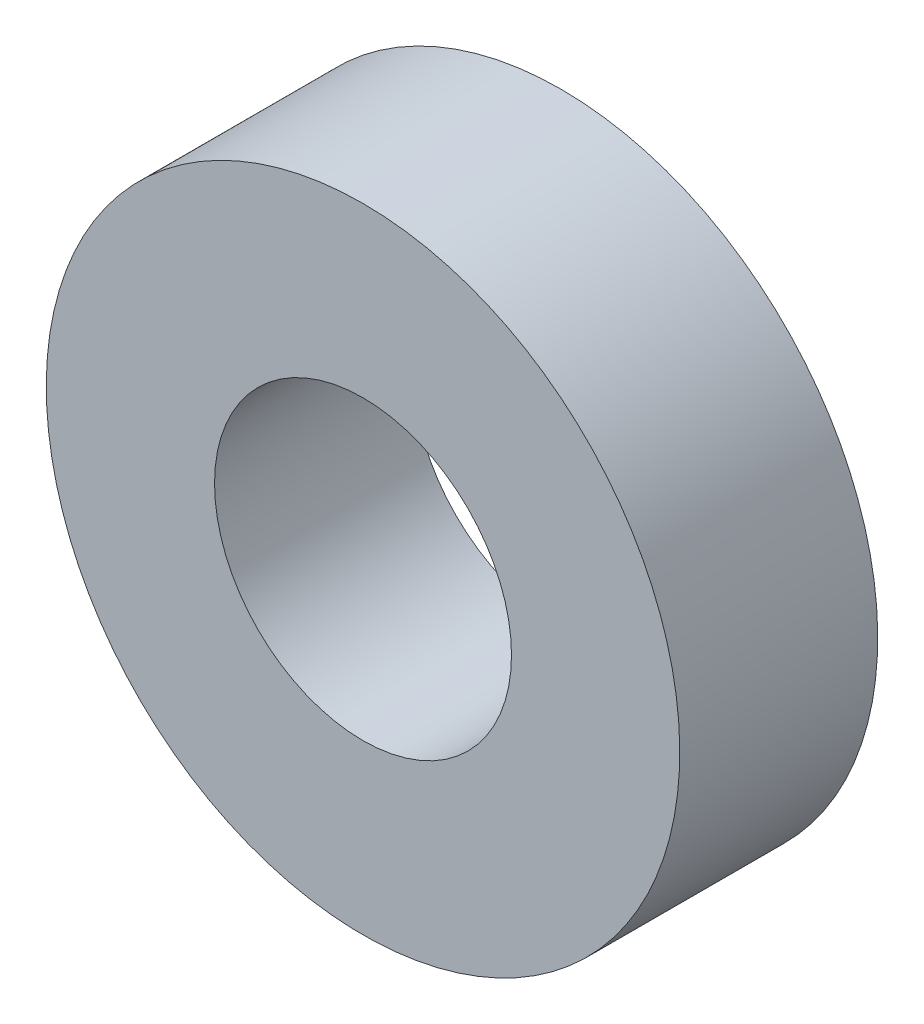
ISO-10303-21;
HEADER;
FILE_DESCRIPTION(('STEP AP214'),'2;1');
FILE_NAME('part.step','',(''),(''),'','','');
FILE_SCHEMA(('AUTOMOTIVE_DESIGN { 1 0 10303 214 1 1 1 1 }'));
ENDSEC;
DATA;
#1=APPLICATION_CONTEXT('core data for automotive mechanical design processes');
#2=APPLICATION_PROTOCOL_DEFINITION('international standard','automotive_design',2000,#1);
#3=PRODUCT_CONTEXT('',#1,'mechanical');
#4=PRODUCT('Part','Part','',(#3));
#5=PRODUCT_RELATED_PRODUCT_CATEGORY('part','',(#4));
#6=PRODUCT_DEFINITION_FORMATION('','',#4);
#7=PRODUCT_DEFINITION_CONTEXT('part definition',#1,'design');
#8=PRODUCT_DEFINITION('design','',#6,#7);
#9=PRODUCT_DEFINITION_SHAPE('','',#8);
#10=(LENGTH_UNIT() NAMED_UNIT(*) SI_UNIT(.MILLI.,.METRE.));
#11=(NAMED_UNIT(*) PLANE_ANGLE_UNIT() SI_UNIT($,.RADIAN.));
#12=(NAMED_UNIT(*) SI_UNIT($,.STERADIAN.) SOLID_ANGLE_UNIT());
#13=UNCERTAINTY_MEASURE_WITH_UNIT(LENGTH_MEASURE(1.E-05),#10,'distance_accuracy_value','');
#14=(GEOMETRIC_REPRESENTATION_CONTEXT(3) GLOBAL_UNCERTAINTY_ASSIGNED_CONTEXT((#13)) GLOBAL_UNIT_ASSIGNED_CONTEXT((#10,
#11,#12)) REPRESENTATION_CONTEXT('',''));
#15=CARTESIAN_POINT('',(0.,0.,0.));
#16=DIRECTION('',(0.,0.,1.));
#17=DIRECTION('',(1.,0.,0.));
#18=AXIS2_PLACEMENT_3D('',#15,#16,#17);
#19=CARTESIAN_POINT('',(0.,0.,-7.));
#20=DIRECTION('',(0.,0.,1.));
#21=DIRECTION('',(0.,-1.,0.));
#22=AXIS2_PLACEMENT_3D('',#19,#20,#21);
#23=PLANE('',#22);
#24=CARTESIAN_POINT('',(0.,0.,-7.));
#25=DIRECTION('',(0.,0.,-1.));
#26=DIRECTION('',(0.,1.,0.));
#27=AXIS2_PLACEMENT_3D('',#24,#25,#26);
#28=CIRCLE('',#27,7.5);
#29=CARTESIAN_POINT('',(0.,7.50000000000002,-7.));
#30=VERTEX_POINT('',#29);
#31=EDGE_CURVE('E32',#30,#30,#28,.F.);
#32=ORIENTED_EDGE('',*,*,#31,.T.);
#33=EDGE_LOOP('',(#32));
#34=FACE_BOUND('',#33,.T.);
#35=CARTESIAN_POINT('',(0.,0.,-7.));
#36=DIRECTION('',(0.,0.,-1.));
#37=DIRECTION('',(0.,1.,0.));
#38=AXIS2_PLACEMENT_3D('',#35,#36,#37);
#39=CIRCLE('',#38,16.);
#40=CARTESIAN_POINT('',(0.,16.,-7.));
#41=VERTEX_POINT('',#40);
#42=EDGE_CURVE('E18',#41,#41,#39,.F.);
#43=ORIENTED_EDGE('',*,*,#42,.F.);
#44=EDGE_LOOP('',(#43));
#45=FACE_BOUND('',#44,.T.);
#46=ADVANCED_FACE('F14',(#34,#45),#23,.F.);
#47=CARTESIAN_POINT('',(0.,0.,3.));
#48=DIRECTION('',(0.,0.,-1.));
#49=DIRECTION('',(0.,1.,0.));
#50=AXIS2_PLACEMENT_3D('',#47,#48,#49);
#51=CYLINDRICAL_SURFACE('',#50,16.);
#52=ORIENTED_EDGE('',*,*,#42,.T.);
#53=EDGE_LOOP('',(#52));
#54=FACE_BOUND('',#53,.T.);
#55=CARTESIAN_POINT('',(0.,0.,3.));
#56=DIRECTION('',(0.,0.,-1.));
#57=DIRECTION('',(0.,1.,0.));
#58=AXIS2_PLACEMENT_3D('',#55,#56,#57);
#59=CIRCLE('',#58,16.);
#60=CARTESIAN_POINT('',(0.,16.,3.));
#61=VERTEX_POINT('',#60);
#62=EDGE_CURVE('E23',#61,#61,#59,.F.);
#63=ORIENTED_EDGE('',*,*,#62,.F.);
#64=EDGE_LOOP('',(#63));
#65=FACE_BOUND('',#64,.T.);
#66=ADVANCED_FACE('F40',(#54,#65),#51,.T.);
#67=CARTESIAN_POINT('',(0.,0.,3.));
#68=DIRECTION('',(0.,0.,-1.));
#69=DIRECTION('',(0.,1.,0.));
#70=AXIS2_PLACEMENT_3D('',#67,#68,#69);
#71=CYLINDRICAL_SURFACE('',#70,7.5);
#72=CARTESIAN_POINT('',(0.,0.,3.));
#73=DIRECTION('',(0.,0.,-1.));
#74=DIRECTION('',(0.,1.,0.));
#75=AXIS2_PLACEMENT_3D('',#72,#73,#74);
#76=CIRCLE('',#75,7.5);
#77=CARTESIAN_POINT('',(0.,7.50000000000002,3.));
#78=VERTEX_POINT('',#77);
#79=EDGE_CURVE('E10',#78,#78,#76,.T.);
#80=ORIENTED_EDGE('',*,*,#79,.F.);
#81=EDGE_LOOP('',(#80));
#82=FACE_BOUND('',#81,.T.);
#83=ORIENTED_EDGE('',*,*,#31,.F.);
#84=EDGE_LOOP('',(#83));
#85=FACE_BOUND('',#84,.T.);
#86=ADVANCED_FACE('F48',(#82,#85),#71,.F.);
#87=CARTESIAN_POINT('',(0.,0.,3.));
#88=DIRECTION('',(0.,0.,1.));
#89=DIRECTION('',(0.,-1.,0.));
#90=AXIS2_PLACEMENT_3D('',#87,#88,#89);
#91=PLANE('',#90);
#92=ORIENTED_EDGE('',*,*,#79,.T.);
#93=EDGE_LOOP('',(#92));
#94=FACE_BOUND('',#93,.T.);
#95=ORIENTED_EDGE('',*,*,#62,.T.);
#96=EDGE_LOOP('',(#95));
#97=FACE_BOUND('',#96,.T.);
#98=ADVANCED_FACE('F16',(#94,#97),#91,.T.);
#99=CLOSED_SHELL('',(#46,#66,#86,#98));
#100=MANIFOLD_SOLID_BREP('B1',#99);
#101=ADVANCED_BREP_SHAPE_REPRESENTATION('',(#18,#100),#14);
#102=SHAPE_DEFINITION_REPRESENTATION(#9,#101);
ENDSEC;
END-ISO-10303-21;
